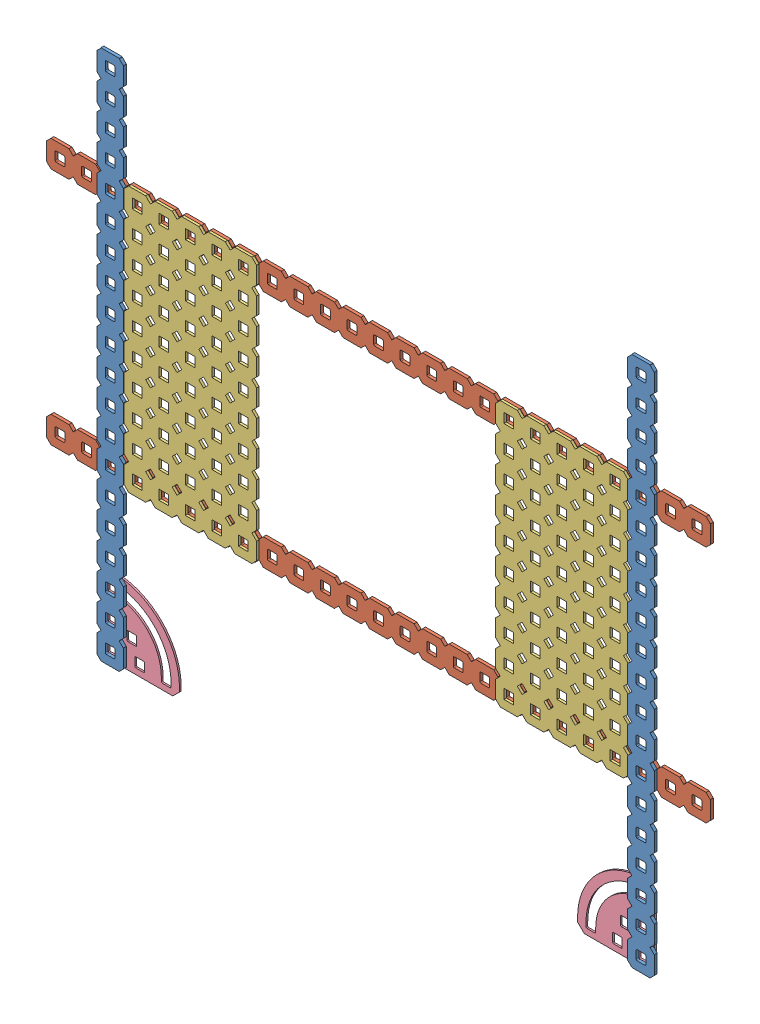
SolidWorks assembly Class Project Side Pannels.SLDASM, configuration Default (file format 10000). Lengths in mm.
Overall size (317.5 254.09 2.84).
8 component instances, 4 part files, 23 mates.
Components (placement in the parent):
- Bar 10inch-1: Bar 10inch.SLDPRT [Default] at (-289.2057 324.6342 -18.5496) x (1 0 0) z (0 1 0) size (12.7 1.42 254.09)
- Bar 12.5inch-1: Bar 12.5inch.SLDPRT [Default] at (-314.6057 96.0342 -21.3944) x (0 -1 0) z (-1 0 0) size (12.7 1.42 317.5)
- Bar 10inch-2: Bar 10inch.SLDPRT [Default] at (-22.5057 324.6342 -19.972) x (-1 0 0) z (0 1 0) size (12.7 1.42 254.09)
- Bar 12.5inch-2: Bar 12.5inch.SLDPRT [Default] at (-314.6057 197.6342 -19.972) x (0 1 0) z (-1 0 0) size (12.7 1.42 317.5)
- Plate 05-10 Steel-1: Plate 05-10 Steel.SLDPRT [Default] at (-213.0057 83.3342 -18.8036) x (-1 0 0) z (0 -1 0) size (63.5 1.17 127)
- Plate 05-10 Steel-2: Plate 05-10 Steel.SLDPRT [Default] at (-98.7057 210.3342 -18.8036) x (1 0 0) z (0 1 0) size (63.5 1.17 127)
- 90 Degree Pivot Gusset-1: 90 Degree Pivot Gusset.SLDPRT [Default] at (-272.9691 18.9131 -20.7848) size (36.83 36.83 0.81)
- 90 Degree Pivot Gusset-2: 90 Degree Pivot Gusset.SLDPRT [Default] at (-34.2846 23.3708 -20.7848) x (0 1 0) z (0 0 1) size (36.83 36.83 0.81)
Mates (geometry in assembly coordinates):
- Coincident1: coincident anti-aligned: plane of Bar 10inch-2 through (-33.3583 32.5342 -19.972) normal (0 0 -1); plane of 90 Degree Pivot Gusset-2 through (-28.8557 13.4842 -19.972) normal (0 0 1)
- Coincident2: coincident anti-aligned: plane of Bar 10inch-2 through (-33.3583 32.5342 -19.972) normal (0 0 -1); plane of 90 Degree Pivot Gusset-1 through (-282.8557 13.4842 -19.972) normal (0 0 1)
- Coincident3: coincident aligned: plane of Bar 10inch-2 through (-31.1671 15.2876 -18.5496) normal (1 0 0); plane of 90 Degree Pivot Gusset-2 through (-31.1671 11.6808 -20.7848) normal (1 0 0)
- Coincident4: coincident aligned: plane of Bar 10inch-2 through (-30.6591 11.1728 -18.5496) normal (0 1 0); plane of 90 Degree Pivot Gusset-2 through (-27.0523 11.1728 -20.7848) normal (0 1 0)
- Coincident5: coincident aligned: plane of Bar 10inch-1 through (-285.1671 11.6808 -19.972) normal (1 0 0); plane of 90 Degree Pivot Gusset-1 through (-285.1671 11.6808 -20.7848) normal (1 0 0)
- Coincident6: coincident aligned: plane of Bar 10inch-1 through (-281.0523 11.1728 -19.972) normal (0 1 0); plane of 90 Degree Pivot Gusset-1 through (-281.0523 11.1728 -20.7848) normal (0 1 0)
- Coincident7: coincident anti-aligned: plane of Bar 12.5inch-1 through (-22.5057 85.1816 -19.972) normal (0 0 1); plane of Bar 10inch-2 through (-33.3583 32.5342 -19.972) normal (0 0 -1)
- Coincident8: coincident aligned: plane of Bar 12.5inch-1 through (-30.6591 87.3728 -19.972) normal (0 1 0); plane of Bar 10inch-2 through (-30.6591 87.3728 -18.5496) normal (0 1 0)
- Coincident9: coincident aligned: plane of Bar 12.5inch-1 through (-31.1671 91.4876 -19.972) normal (1 0 0); plane of Bar 10inch-2 through (-31.1671 91.4876 -18.5496) normal (1 0 0)
- Coincident10: coincident aligned: plane of Bar 12.5inch-1 through (-43.3591 87.3728 -19.972) normal (0 1 0); plane of Plate 05-10 Steel-2 through (-43.8671 87.3728 -18.8036) normal (0 1 0)
- Coincident11: coincident aligned: plane of Bar 12.5inch-1 through (-43.8671 91.4876 -19.972) normal (1 0 0); plane of Plate 05-10 Steel-2 through (-43.8671 91.9956 -18.8036) normal (1 0 0)
- Coincident12: coincident aligned: plane of Bar 12.5inch-1 through (-221.1591 87.3728 -19.972) normal (0 1 0); plane of Plate 05-10 Steel-1 through (-221.6671 87.3728 -18.8036) normal (0 1 0)
- Coincident13: coincident aligned: plane of Bar 12.5inch-1 through (-221.6671 91.4876 -19.972) normal (1 0 0); plane of Plate 05-10 Steel-1 through (-221.6671 91.9956 -18.8036) normal (1 0 0)
- Coincident14: coincident anti-aligned: plane of Bar 12.5inch-1 through (-22.5057 85.1816 -19.972) normal (0 0 1); plane of Plate 05-10 Steel-1 through (-213.0057 83.3342 -19.972) normal (0 0 -1)
- Coincident15: coincident anti-aligned: plane of Bar 12.5inch-1 through (-22.5057 85.1816 -19.972) normal (0 0 1); plane of Plate 05-10 Steel-2 through (-98.7057 210.3342 -19.972) normal (0 0 -1)
- Coincident16: coincident aligned: plane of Bar 10inch-1 through (-285.1671 87.8808 -19.972) normal (1 0 0); plane of Bar 12.5inch-1 through (-285.1671 91.4876 -19.972) normal (1 0 0)
- Coincident17: coincident aligned: plane of Bar 10inch-1 through (-281.0523 87.3728 -19.972) normal (0 1 0); plane of Bar 12.5inch-1 through (-284.6591 87.3728 -19.972) normal (0 1 0)
- Coincident18: coincident anti-aligned: plane of Bar 10inch-2 through (-33.3583 32.5342 -19.972) normal (0 0 -1); plane of Bar 12.5inch-2 through (-22.5057 208.4869 -19.972) normal (0 0 1)
- Coincident19: coincident aligned: plane of Bar 10inch-2 through (-31.1671 205.7876 -18.5496) normal (1 0 0); plane of Bar 12.5inch-2 through (-31.1671 202.1808 -21.3944) normal (1 0 0)
- Coincident20: coincident aligned: plane of Bar 10inch-2 through (-30.6591 201.6728 -18.5496) normal (0 1 0); plane of Bar 12.5inch-2 through (-27.0523 201.6728 -21.3944) normal (0 1 0)
- Coincident21: coincident aligned: plane of Bar 10inch-1 through (-285.1671 202.1808 -19.972) normal (1 0 0); plane of Bar 12.5inch-2 through (-285.1671 202.1808 -21.3944) normal (1 0 0)
- Coincident22: coincident aligned: plane of Bar 10inch-1 through (-281.0523 201.6728 -19.972) normal (0 1 0); plane of Bar 12.5inch-2 through (-281.0523 201.6728 -21.3944) normal (0 1 0)
- Coincident23: coincident anti-aligned: plane of Bar 10inch-1 through (-278.3531 32.5342 -19.972) normal (0 0 -1); plane of Bar 12.5inch-2 through (-22.5057 208.4869 -19.972) normal (0 0 1)
